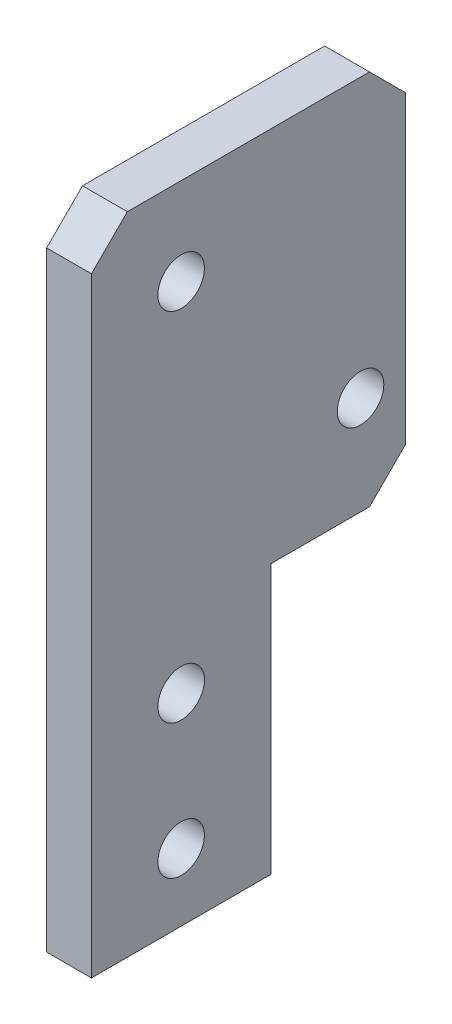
ISO-10303-21;
HEADER;
FILE_DESCRIPTION(('STEP AP214'),'2;1');
FILE_NAME('part.step','',(''),(''),'','','');
FILE_SCHEMA(('AUTOMOTIVE_DESIGN { 1 0 10303 214 1 1 1 1 }'));
ENDSEC;
DATA;
#1=APPLICATION_CONTEXT('core data for automotive mechanical design processes');
#2=APPLICATION_PROTOCOL_DEFINITION('international standard','automotive_design',2000,#1);
#3=PRODUCT_CONTEXT('',#1,'mechanical');
#4=PRODUCT('Part','Part','',(#3));
#5=PRODUCT_RELATED_PRODUCT_CATEGORY('part','',(#4));
#6=PRODUCT_DEFINITION_FORMATION('','',#4);
#7=PRODUCT_DEFINITION_CONTEXT('part definition',#1,'design');
#8=PRODUCT_DEFINITION('design','',#6,#7);
#9=PRODUCT_DEFINITION_SHAPE('','',#8);
#10=(LENGTH_UNIT() NAMED_UNIT(*) SI_UNIT(.MILLI.,.METRE.));
#11=(NAMED_UNIT(*) PLANE_ANGLE_UNIT() SI_UNIT($,.RADIAN.));
#12=(NAMED_UNIT(*) SI_UNIT($,.STERADIAN.) SOLID_ANGLE_UNIT());
#13=UNCERTAINTY_MEASURE_WITH_UNIT(LENGTH_MEASURE(1.E-05),#10,'distance_accuracy_value','');
#14=(GEOMETRIC_REPRESENTATION_CONTEXT(3) GLOBAL_UNCERTAINTY_ASSIGNED_CONTEXT((#13)) GLOBAL_UNIT_ASSIGNED_CONTEXT((#10,
#11,#12)) REPRESENTATION_CONTEXT('',''));
#15=CARTESIAN_POINT('',(0.,0.,0.));
#16=DIRECTION('',(0.,0.,1.));
#17=DIRECTION('',(1.,0.,0.));
#18=AXIS2_PLACEMENT_3D('',#15,#16,#17);
#19=CARTESIAN_POINT('',(2.49999994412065,19.0000003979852,7.99999999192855));
#20=DIRECTION('',(0.,-0.707106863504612,-0.707106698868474));
#21=DIRECTION('',(0.,0.707106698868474,-0.707106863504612));
#22=AXIS2_PLACEMENT_3D('',#19,#20,#21);
#23=PLANE('',#22);
#24=DIRECTION('',(0.,0.707106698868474,-0.707106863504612));
#25=VECTOR('',#24,1.);
#26=CARTESIAN_POINT('',(4.99999988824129,9.75000446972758,17.2499980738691));
#27=LINE('',#26,#25);
#28=CARTESIAN_POINT('',(4.99999988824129,20.9999997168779,6.00000020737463));
#29=VERTEX_POINT('',#28);
#30=CARTESIAN_POINT('',(4.99999988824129,17.0000010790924,9.99999977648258));
#31=VERTEX_POINT('',#30);
#32=EDGE_CURVE('E178',#29,#31,#27,.F.);
#33=ORIENTED_EDGE('',*,*,#32,.F.);
#34=DIRECTION('',(1.,0.,0.));
#35=VECTOR('',#34,1.);
#36=CARTESIAN_POINT('',(2.49999994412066,20.9999997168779,6.00000020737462));
#37=LINE('',#36,#35);
#38=CARTESIAN_POINT('',(1.53566395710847E-12,20.9999997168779,6.00000020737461));
#39=VERTEX_POINT('',#38);
#40=EDGE_CURVE('E233',#29,#39,#37,.F.);
#41=ORIENTED_EDGE('',*,*,#40,.T.);
#42=DIRECTION('',(0.,-0.707106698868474,0.707106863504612));
#43=VECTOR('',#42,1.);
#44=CARTESIAN_POINT('',(1.5859709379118E-12,19.0000003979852,7.99999999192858));
#45=LINE('',#44,#43);
#46=CARTESIAN_POINT('',(1.63671159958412E-12,17.0000010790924,9.99999977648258));
#47=VERTEX_POINT('',#46);
#48=EDGE_CURVE('E205',#39,#47,#45,.T.);
#49=ORIENTED_EDGE('',*,*,#48,.T.);
#50=DIRECTION('',(-1.,0.,0.));
#51=VECTOR('',#50,1.);
#52=CARTESIAN_POINT('',(2.49999994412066,17.0000010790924,9.99999977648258));
#53=LINE('',#52,#51);
#54=EDGE_CURVE('E201',#47,#31,#53,.F.);
#55=ORIENTED_EDGE('',*,*,#54,.T.);
#56=EDGE_LOOP('',(#33,#41,#49,#55));
#57=FACE_BOUND('',#56,.T.);
#58=ADVANCED_FACE('F62',(#57),#23,.F.);
#59=CARTESIAN_POINT('',(2.49999994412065,-20.9999997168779,-15.4999997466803));
#60=DIRECTION('',(0.,-1.,0.));
#61=DIRECTION('',(0.,0.,-1.));
#62=AXIS2_PLACEMENT_3D('',#59,#60,#61);
#63=PLANE('',#62);
#64=DIRECTION('',(-1.,0.,0.));
#65=VECTOR('',#64,1.);
#66=CARTESIAN_POINT('',(2.49999994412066,-20.9999997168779,-21.000000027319));
#67=LINE('',#66,#65);
#68=CARTESIAN_POINT('',(4.99999988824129,-20.9999997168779,-21.000000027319));
#69=VERTEX_POINT('',#68);
#70=CARTESIAN_POINT('',(-3.38271077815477E-13,-20.9999997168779,-21.000000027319));
#71=VERTEX_POINT('',#70);
#72=EDGE_CURVE('E82',#69,#71,#67,.T.);
#73=ORIENTED_EDGE('',*,*,#72,.F.);
#74=DIRECTION('',(0.,0.,1.));
#75=VECTOR('',#74,1.);
#76=CARTESIAN_POINT('',(4.99999988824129,-20.9999997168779,-15.4999997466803));
#77=LINE('',#76,#75);
#78=CARTESIAN_POINT('',(4.99999988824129,-20.9999997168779,-9.99999977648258));
#79=VERTEX_POINT('',#78);
#80=EDGE_CURVE('E146',#69,#79,#77,.T.);
#81=ORIENTED_EDGE('',*,*,#80,.T.);
#82=DIRECTION('',(-1.,0.,0.));
#83=VECTOR('',#82,1.);
#84=CARTESIAN_POINT('',(2.49999994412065,-20.9999997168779,-9.99999977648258));
#85=LINE('',#84,#83);
#86=CARTESIAN_POINT('',(1.29670579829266E-13,-20.9999997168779,-9.99999977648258));
#87=VERTEX_POINT('',#86);
#88=EDGE_CURVE('E149',#87,#79,#85,.F.);
#89=ORIENTED_EDGE('',*,*,#88,.F.);
#90=DIRECTION('',(0.,0.,1.));
#91=VECTOR('',#90,1.);
#92=CARTESIAN_POINT('',(-1.04517089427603E-13,-20.9999997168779,-15.4999997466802));
#93=LINE('',#92,#91);
#94=EDGE_CURVE('E164',#87,#71,#93,.F.);
#95=ORIENTED_EDGE('',*,*,#94,.T.);
#96=EDGE_LOOP('',(#73,#81,#89,#95));
#97=FACE_BOUND('',#96,.T.);
#98=ADVANCED_FACE('F148',(#97),#63,.T.);
#99=CARTESIAN_POINT('',(2.49999994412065,-50.9999990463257,0.));
#100=DIRECTION('',(0.,-1.,0.));
#101=DIRECTION('',(0.,0.,-1.));
#102=AXIS2_PLACEMENT_3D('',#99,#100,#101);
#103=PLANE('',#102);
#104=DIRECTION('',(0.,0.,-1.));
#105=VECTOR('',#104,1.);
#106=CARTESIAN_POINT('',(4.99999988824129,-50.9999990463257,-7.50000029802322));
#107=LINE('',#106,#105);
#108=CARTESIAN_POINT('',(4.99999988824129,-50.9999990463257,9.99999977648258));
#109=VERTEX_POINT('',#108);
#110=CARTESIAN_POINT('',(4.99999988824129,-50.9999990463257,-9.99999977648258));
#111=VERTEX_POINT('',#110);
#112=EDGE_CURVE('E168',#109,#111,#107,.T.);
#113=ORIENTED_EDGE('',*,*,#112,.F.);
#114=DIRECTION('',(1.,0.,0.));
#115=VECTOR('',#114,1.);
#116=CARTESIAN_POINT('',(2.49999994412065,-50.9999990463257,9.99999977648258));
#117=LINE('',#116,#115);
#118=CARTESIAN_POINT('',(4.61870125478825E-13,-50.9999990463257,9.99999977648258));
#119=VERTEX_POINT('',#118);
#120=EDGE_CURVE('E200',#119,#109,#117,.T.);
#121=ORIENTED_EDGE('',*,*,#120,.F.);
#122=DIRECTION('',(0.,0.,1.));
#123=VECTOR('',#122,1.);
#124=CARTESIAN_POINT('',(0.,-50.9999990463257,1.06344111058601E-13));
#125=LINE('',#124,#123);
#126=CARTESIAN_POINT('',(-3.88578058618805E-13,-50.9999990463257,-9.99999977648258));
#127=VERTEX_POINT('',#126);
#128=EDGE_CURVE('E180',#119,#127,#125,.F.);
#129=ORIENTED_EDGE('',*,*,#128,.T.);
#130=DIRECTION('',(-1.,0.,0.));
#131=VECTOR('',#130,1.);
#132=CARTESIAN_POINT('',(2.49999994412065,-50.9999990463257,-9.99999977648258));
#133=LINE('',#132,#131);
#134=EDGE_CURVE('E174',#127,#111,#133,.F.);
#135=ORIENTED_EDGE('',*,*,#134,.T.);
#136=EDGE_LOOP('',(#113,#121,#129,#135));
#137=FACE_BOUND('',#136,.T.);
#138=ADVANCED_FACE('F341',(#137),#103,.T.);
#139=CARTESIAN_POINT('',(2.49999994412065,19.0000004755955,-23.0000001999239));
#140=DIRECTION('',(0.,0.707106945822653,-0.707106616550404));
#141=DIRECTION('',(0.,0.707106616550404,0.707106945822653));
#142=AXIS2_PLACEMENT_3D('',#139,#140,#141);
#143=PLANE('',#142);
#144=DIRECTION('',(0.,0.707106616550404,0.707106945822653));
#145=VECTOR('',#144,1.);
#146=CARTESIAN_POINT('',(4.99999988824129,9.7500082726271,-32.2499967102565));
#147=LINE('',#146,#145);
#148=CARTESIAN_POINT('',(4.99999988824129,17.0000012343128,-25.000000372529));
#149=VERTEX_POINT('',#148);
#150=CARTESIAN_POINT('',(4.99999988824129,20.9999997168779,-21.000000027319));
#151=VERTEX_POINT('',#150);
#152=EDGE_CURVE('E189',#149,#151,#147,.T.);
#153=ORIENTED_EDGE('',*,*,#152,.F.);
#154=DIRECTION('',(-1.,0.,0.));
#155=VECTOR('',#154,1.);
#156=CARTESIAN_POINT('',(2.49999994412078,17.0000012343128,-25.000000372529));
#157=LINE('',#156,#155);
#158=CARTESIAN_POINT('',(1.48318857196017E-13,17.0000012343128,-25.000000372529));
#159=VERTEX_POINT('',#158);
#160=EDGE_CURVE('E186',#159,#149,#157,.F.);
#161=ORIENTED_EDGE('',*,*,#160,.F.);
#162=DIRECTION('',(0.,-0.707106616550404,-0.707106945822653));
#163=VECTOR('',#162,1.);
#164=CARTESIAN_POINT('',(2.67581096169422E-13,19.0000004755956,-23.0000001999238));
#165=LINE('',#164,#163);
#166=CARTESIAN_POINT('',(3.87277016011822E-13,20.9999997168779,-21.000000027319));
#167=VERTEX_POINT('',#166);
#168=EDGE_CURVE('E66',#159,#167,#165,.F.);
#169=ORIENTED_EDGE('',*,*,#168,.T.);
#170=DIRECTION('',(-1.,0.,0.));
#171=VECTOR('',#170,1.);
#172=CARTESIAN_POINT('',(2.49999994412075,20.9999997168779,-21.000000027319));
#173=LINE('',#172,#171);
#174=EDGE_CURVE('E299',#151,#167,#173,.T.);
#175=ORIENTED_EDGE('',*,*,#174,.F.);
#176=EDGE_LOOP('',(#153,#161,#169,#175));
#177=FACE_BOUND('',#176,.T.);
#178=ADVANCED_FACE('F319',(#177),#143,.T.);
#179=CARTESIAN_POINT('',(-8.99664717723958E-09,-43.4999987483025,-9.84071866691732E-12));
#180=DIRECTION('',(1.,3.46025186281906E-09,1.9674498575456E-12));
#181=DIRECTION('',(-3.46025186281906E-09,1.,0.));
#182=AXIS2_PLACEMENT_3D('',#179,#180,#181);
#183=CYLINDRICAL_SURFACE('',#182,2.59583311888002);
#184=CARTESIAN_POINT('',(4.99999988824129,-43.4999987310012,0.));
#185=DIRECTION('',(1.,0.,0.));
#186=DIRECTION('',(0.,0.,-1.));
#187=AXIS2_PLACEMENT_3D('',#184,#185,#186);
#188=CIRCLE('',#187,2.59583311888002);
#189=CARTESIAN_POINT('',(4.99999988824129,-43.4999987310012,-2.59583311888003));
#190=VERTEX_POINT('',#189);
#191=EDGE_CURVE('E229',#190,#190,#188,.F.);
#192=ORIENTED_EDGE('',*,*,#191,.F.);
#193=EDGE_LOOP('',(#192));
#194=FACE_BOUND('',#193,.T.);
#195=CARTESIAN_POINT('',(1.66394091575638E-13,-43.4999987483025,-9.84071864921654E-12));
#196=DIRECTION('',(1.,0.,0.));
#197=DIRECTION('',(0.,0.,-1.));
#198=AXIS2_PLACEMENT_3D('',#195,#196,#197);
#199=CIRCLE('',#198,2.59583311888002);
#200=CARTESIAN_POINT('',(0.,-43.4999987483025,-2.59583311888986));
#201=VERTEX_POINT('',#200);
#202=EDGE_CURVE('E210',#201,#201,#199,.F.);
#203=ORIENTED_EDGE('',*,*,#202,.T.);
#204=EDGE_LOOP('',(#203));
#205=FACE_BOUND('',#204,.T.);
#206=ADVANCED_FACE('F352',(#194,#205),#183,.F.);
#207=CARTESIAN_POINT('',(4.99999988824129,11.2500004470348,0.));
#208=DIRECTION('',(-1.,8.77201866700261E-10,0.));
#209=DIRECTION('',(-8.77201866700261E-10,-1.,0.));
#210=AXIS2_PLACEMENT_3D('',#207,#208,#209);
#211=CYLINDRICAL_SURFACE('',#210,2.59583360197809);
#212=CARTESIAN_POINT('',(4.99999988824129,11.2500004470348,0.));
#213=DIRECTION('',(1.,0.,0.));
#214=DIRECTION('',(0.,0.,-1.));
#215=AXIS2_PLACEMENT_3D('',#212,#213,#214);
#216=CIRCLE('',#215,2.59583360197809);
#217=CARTESIAN_POINT('',(4.99999988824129,11.2500004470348,-2.59583360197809));
#218=VERTEX_POINT('',#217);
#219=EDGE_CURVE('E12',#218,#218,#216,.F.);
#220=ORIENTED_EDGE('',*,*,#219,.F.);
#221=EDGE_LOOP('',(#220));
#222=FACE_BOUND('',#221,.T.);
#223=CARTESIAN_POINT('',(1.11282510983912E-12,11.2500004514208,0.));
#224=DIRECTION('',(1.,0.,0.));
#225=DIRECTION('',(0.,0.,-1.));
#226=AXIS2_PLACEMENT_3D('',#223,#224,#225);
#227=CIRCLE('',#226,2.59583360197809);
#228=CARTESIAN_POINT('',(1.00240446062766E-12,11.2500004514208,-2.59583360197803));
#229=VERTEX_POINT('',#228);
#230=EDGE_CURVE('E214',#229,#229,#227,.F.);
#231=ORIENTED_EDGE('',*,*,#230,.T.);
#232=EDGE_LOOP('',(#231));
#233=FACE_BOUND('',#232,.T.);
#234=ADVANCED_FACE('F472',(#222,#233),#211,.F.);
#235=CARTESIAN_POINT('',(4.99999988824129,-9.99999977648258,-19.9999995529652));
#236=DIRECTION('',(-1.,-7.79782127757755E-10,-1.55598445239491E-09));
#237=DIRECTION('',(-1.55598445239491E-09,0.,1.));
#238=AXIS2_PLACEMENT_3D('',#235,#236,#237);
#239=CYLINDRICAL_SURFACE('',#238,2.59583343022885);
#240=CARTESIAN_POINT('',(4.99999988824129,-9.99999977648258,-19.9999995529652));
#241=DIRECTION('',(1.,0.,0.));
#242=DIRECTION('',(0.,0.,-1.));
#243=AXIS2_PLACEMENT_3D('',#240,#241,#242);
#244=CIRCLE('',#243,2.59583343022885);
#245=CARTESIAN_POINT('',(4.99999988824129,-9.99999977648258,-22.595832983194));
#246=VERTEX_POINT('',#245);
#247=EDGE_CURVE('E226',#246,#246,#244,.F.);
#248=ORIENTED_EDGE('',*,*,#247,.F.);
#249=EDGE_LOOP('',(#248));
#250=FACE_BOUND('',#249,.T.);
#251=CARTESIAN_POINT('',(-1.04950770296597E-13,-9.99999978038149,-19.9999995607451));
#252=DIRECTION('',(1.,0.,0.));
#253=DIRECTION('',(0.,0.,-1.));
#254=AXIS2_PLACEMENT_3D('',#251,#252,#253);
#255=CIRCLE('',#254,2.59583343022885);
#256=CARTESIAN_POINT('',(-2.15371412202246E-13,-9.99999978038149,-22.5958329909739));
#257=VERTEX_POINT('',#256);
#258=EDGE_CURVE('E218',#257,#257,#255,.F.);
#259=ORIENTED_EDGE('',*,*,#258,.T.);
#260=EDGE_LOOP('',(#259));
#261=FACE_BOUND('',#260,.T.);
#262=ADVANCED_FACE('F403',(#250,#261),#239,.F.);
#263=CARTESIAN_POINT('',(-5.81983072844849E-09,-28.5000000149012,8.44198880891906E-13));
#264=DIRECTION('',(1.,2.23839546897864E-09,-1.69793880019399E-13));
#265=DIRECTION('',(-2.23839546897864E-09,1.,0.));
#266=AXIS2_PLACEMENT_3D('',#263,#264,#265);
#267=CYLINDRICAL_SURFACE('',#266,2.59583342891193);
#268=CARTESIAN_POINT('',(4.99999988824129,-28.5000000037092,0.));
#269=DIRECTION('',(1.,0.,0.));
#270=DIRECTION('',(0.,0.,-1.));
#271=AXIS2_PLACEMENT_3D('',#268,#269,#270);
#272=CIRCLE('',#271,2.59583342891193);
#273=CARTESIAN_POINT('',(4.99999988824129,-28.5000000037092,-2.59583342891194));
#274=VERTEX_POINT('',#273);
#275=EDGE_CURVE('E73',#274,#274,#272,.F.);
#276=ORIENTED_EDGE('',*,*,#275,.F.);
#277=EDGE_LOOP('',(#276));
#278=FACE_BOUND('',#277,.T.);
#279=CARTESIAN_POINT('',(4.25543595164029E-13,-28.5000000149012,8.44198879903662E-13));
#280=DIRECTION('',(1.,0.,0.));
#281=DIRECTION('',(0.,0.,-1.));
#282=AXIS2_PLACEMENT_3D('',#279,#280,#281);
#283=CIRCLE('',#282,2.59583342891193);
#284=CARTESIAN_POINT('',(3.15122953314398E-13,-28.5000000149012,-2.59583342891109));
#285=VERTEX_POINT('',#284);
#286=EDGE_CURVE('E222',#285,#285,#283,.F.);
#287=ORIENTED_EDGE('',*,*,#286,.T.);
#288=EDGE_LOOP('',(#287));
#289=FACE_BOUND('',#288,.T.);
#290=ADVANCED_FACE('F344',(#278,#289),#267,.F.);
#291=CARTESIAN_POINT('',(2.49999994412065,20.9999997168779,-7.49999983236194));
#292=DIRECTION('',(0.,1.,0.));
#293=DIRECTION('',(0.,0.,1.));
#294=AXIS2_PLACEMENT_3D('',#291,#292,#293);
#295=PLANE('',#294);
#296=ORIENTED_EDGE('',*,*,#174,.T.);
#297=DIRECTION('',(0.,0.,-1.));
#298=VECTOR('',#297,1.);
#299=CARTESIAN_POINT('',(9.61470486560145E-13,20.9999997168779,-7.49999983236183));
#300=LINE('',#299,#298);
#301=EDGE_CURVE('E130',#167,#39,#300,.F.);
#302=ORIENTED_EDGE('',*,*,#301,.T.);
#303=ORIENTED_EDGE('',*,*,#40,.F.);
#304=DIRECTION('',(0.,0.,-1.));
#305=VECTOR('',#304,1.);
#306=CARTESIAN_POINT('',(4.99999988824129,20.9999997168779,-7.49999983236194));
#307=LINE('',#306,#305);
#308=EDGE_CURVE('E138',#29,#151,#307,.T.);
#309=ORIENTED_EDGE('',*,*,#308,.T.);
#310=EDGE_LOOP('',(#296,#302,#303,#309));
#311=FACE_BOUND('',#310,.T.);
#312=ADVANCED_FACE('F317',(#311),#295,.T.);
#313=CARTESIAN_POINT('',(4.99999988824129,-14.9999996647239,-7.50000029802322));
#314=DIRECTION('',(1.,0.,0.));
#315=DIRECTION('',(0.,0.,-1.));
#316=AXIS2_PLACEMENT_3D('',#313,#314,#315);
#317=PLANE('',#316);
#318=ORIENTED_EDGE('',*,*,#191,.T.);
#319=EDGE_LOOP('',(#318));
#320=FACE_BOUND('',#319,.T.);
#321=ORIENTED_EDGE('',*,*,#247,.T.);
#322=EDGE_LOOP('',(#321));
#323=FACE_BOUND('',#322,.T.);
#324=ORIENTED_EDGE('',*,*,#275,.T.);
#325=EDGE_LOOP('',(#324));
#326=FACE_BOUND('',#325,.T.);
#327=ORIENTED_EDGE('',*,*,#219,.T.);
#328=EDGE_LOOP('',(#327));
#329=FACE_BOUND('',#328,.T.);
#330=ORIENTED_EDGE('',*,*,#308,.F.);
#331=ORIENTED_EDGE('',*,*,#32,.T.);
#332=DIRECTION('',(0.,-1.,0.));
#333=VECTOR('',#332,1.);
#334=CARTESIAN_POINT('',(4.99999988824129,-14.9999996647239,9.99999977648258));
#335=LINE('',#334,#333);
#336=EDGE_CURVE('E197',#31,#109,#335,.T.);
#337=ORIENTED_EDGE('',*,*,#336,.T.);
#338=ORIENTED_EDGE('',*,*,#112,.T.);
#339=DIRECTION('',(0.,-1.,0.));
#340=VECTOR('',#339,1.);
#341=CARTESIAN_POINT('',(4.99999988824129,-14.9999996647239,-9.99999977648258));
#342=LINE('',#341,#340);
#343=EDGE_CURVE('E159',#111,#79,#342,.F.);
#344=ORIENTED_EDGE('',*,*,#343,.T.);
#345=ORIENTED_EDGE('',*,*,#80,.F.);
#346=DIRECTION('',(0.,0.707106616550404,-0.707106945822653));
#347=VECTOR('',#346,1.);
#348=CARTESIAN_POINT('',(4.99999988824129,-24.7500009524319,-17.2499970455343));
#349=LINE('',#348,#347);
#350=CARTESIAN_POINT('',(4.99999988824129,-17.0000012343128,-25.000000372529));
#351=VERTEX_POINT('',#350);
#352=EDGE_CURVE('E154',#69,#351,#349,.T.);
#353=ORIENTED_EDGE('',*,*,#352,.T.);
#354=DIRECTION('',(0.,-1.,0.));
#355=VECTOR('',#354,1.);
#356=CARTESIAN_POINT('',(4.99999988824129,-14.9999996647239,-25.000000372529));
#357=LINE('',#356,#355);
#358=EDGE_CURVE('E182',#351,#149,#357,.F.);
#359=ORIENTED_EDGE('',*,*,#358,.T.);
#360=ORIENTED_EDGE('',*,*,#152,.T.);
#361=EDGE_LOOP('',(#330,#331,#337,#338,#344,#345,#353,#359,#360));
#362=FACE_BOUND('',#361,.T.);
#363=ADVANCED_FACE('F166',(#320,#323,#326,#329,#362),#317,.T.);
#364=CARTESIAN_POINT('',(2.49999994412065,-35.9999993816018,-9.99999977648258));
#365=DIRECTION('',(0.,0.,1.));
#366=DIRECTION('',(1.,0.,0.));
#367=AXIS2_PLACEMENT_3D('',#364,#365,#366);
#368=PLANE('',#367);
#369=ORIENTED_EDGE('',*,*,#134,.F.);
#370=DIRECTION('',(0.,1.,0.));
#371=VECTOR('',#370,1.);
#372=CARTESIAN_POINT('',(-1.29670579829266E-13,-35.9999993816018,-9.99999977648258));
#373=LINE('',#372,#371);
#374=EDGE_CURVE('E161',#127,#87,#373,.T.);
#375=ORIENTED_EDGE('',*,*,#374,.T.);
#376=ORIENTED_EDGE('',*,*,#88,.T.);
#377=ORIENTED_EDGE('',*,*,#343,.F.);
#378=EDGE_LOOP('',(#369,#375,#376,#377));
#379=FACE_BOUND('',#378,.T.);
#380=ADVANCED_FACE('F158',(#379),#368,.F.);
#381=CARTESIAN_POINT('',(2.49999994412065,0.,-25.000000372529));
#382=DIRECTION('',(0.,0.,1.));
#383=DIRECTION('',(1.,0.,0.));
#384=AXIS2_PLACEMENT_3D('',#381,#382,#383);
#385=PLANE('',#384);
#386=DIRECTION('',(1.,0.,0.));
#387=VECTOR('',#386,1.);
#388=CARTESIAN_POINT('',(2.4999999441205,-17.0000012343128,-25.000000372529));
#389=LINE('',#388,#387);
#390=CARTESIAN_POINT('',(-4.39318720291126E-13,-17.0000012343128,-25.000000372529));
#391=VERTEX_POINT('',#390);
#392=EDGE_CURVE('E185',#351,#391,#389,.F.);
#393=ORIENTED_EDGE('',*,*,#392,.T.);
#394=DIRECTION('',(0.,1.,0.));
#395=VECTOR('',#394,1.);
#396=CARTESIAN_POINT('',(-1.45283091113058E-13,0.,-25.000000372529));
#397=LINE('',#396,#395);
#398=EDGE_CURVE('E122',#391,#159,#397,.T.);
#399=ORIENTED_EDGE('',*,*,#398,.T.);
#400=ORIENTED_EDGE('',*,*,#160,.T.);
#401=ORIENTED_EDGE('',*,*,#358,.F.);
#402=EDGE_LOOP('',(#393,#399,#400,#401));
#403=FACE_BOUND('',#402,.T.);
#404=ADVANCED_FACE('F323',(#403),#385,.F.);
#405=CARTESIAN_POINT('',(2.49999994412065,-19.0000004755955,-23.0000001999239));
#406=DIRECTION('',(0.,-0.707106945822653,-0.707106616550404));
#407=DIRECTION('',(0.,0.707106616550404,-0.707106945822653));
#408=AXIS2_PLACEMENT_3D('',#405,#406,#407);
#409=PLANE('',#408);
#410=ORIENTED_EDGE('',*,*,#352,.F.);
#411=ORIENTED_EDGE('',*,*,#72,.T.);
#412=DIRECTION('',(0.,-0.707106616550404,0.707106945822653));
#413=VECTOR('',#412,1.);
#414=CARTESIAN_POINT('',(-3.88578058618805E-13,-19.0000004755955,-23.0000001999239));
#415=LINE('',#414,#413);
#416=EDGE_CURVE('E194',#71,#391,#415,.F.);
#417=ORIENTED_EDGE('',*,*,#416,.T.);
#418=ORIENTED_EDGE('',*,*,#392,.F.);
#419=EDGE_LOOP('',(#410,#411,#417,#418));
#420=FACE_BOUND('',#419,.T.);
#421=ADVANCED_FACE('F325',(#420),#409,.T.);
#422=CARTESIAN_POINT('',(2.49999994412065,-16.9999990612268,9.99999977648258));
#423=DIRECTION('',(0.,0.,1.));
#424=DIRECTION('',(1.,0.,0.));
#425=AXIS2_PLACEMENT_3D('',#422,#423,#424);
#426=PLANE('',#425);
#427=ORIENTED_EDGE('',*,*,#54,.F.);
#428=DIRECTION('',(0.,1.,0.));
#429=VECTOR('',#428,1.);
#430=CARTESIAN_POINT('',(1.04907402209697E-12,-16.9999990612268,9.99999977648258));
#431=LINE('',#430,#429);
#432=EDGE_CURVE('E209',#47,#119,#431,.F.);
#433=ORIENTED_EDGE('',*,*,#432,.T.);
#434=ORIENTED_EDGE('',*,*,#120,.T.);
#435=ORIENTED_EDGE('',*,*,#336,.F.);
#436=EDGE_LOOP('',(#427,#433,#434,#435));
#437=FACE_BOUND('',#436,.T.);
#438=ADVANCED_FACE('F327',(#437),#426,.T.);
#439=CARTESIAN_POINT('',(3.39745821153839E-13,-14.9999996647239,-7.50000029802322));
#440=DIRECTION('',(1.,0.,0.));
#441=DIRECTION('',(0.,0.,-1.));
#442=AXIS2_PLACEMENT_3D('',#439,#440,#441);
#443=PLANE('',#442);
#444=ORIENTED_EDGE('',*,*,#202,.F.);
#445=EDGE_LOOP('',(#444));
#446=FACE_BOUND('',#445,.T.);
#447=ORIENTED_EDGE('',*,*,#230,.F.);
#448=EDGE_LOOP('',(#447));
#449=FACE_BOUND('',#448,.T.);
#450=ORIENTED_EDGE('',*,*,#258,.F.);
#451=EDGE_LOOP('',(#450));
#452=FACE_BOUND('',#451,.T.);
#453=ORIENTED_EDGE('',*,*,#286,.F.);
#454=EDGE_LOOP('',(#453));
#455=FACE_BOUND('',#454,.T.);
#456=ORIENTED_EDGE('',*,*,#301,.F.);
#457=ORIENTED_EDGE('',*,*,#168,.F.);
#458=ORIENTED_EDGE('',*,*,#398,.F.);
#459=ORIENTED_EDGE('',*,*,#416,.F.);
#460=ORIENTED_EDGE('',*,*,#94,.F.);
#461=ORIENTED_EDGE('',*,*,#374,.F.);
#462=ORIENTED_EDGE('',*,*,#128,.F.);
#463=ORIENTED_EDGE('',*,*,#432,.F.);
#464=ORIENTED_EDGE('',*,*,#48,.F.);
#465=EDGE_LOOP('',(#456,#457,#458,#459,#460,#461,#462,#463,#464));
#466=FACE_BOUND('',#465,.T.);
#467=ADVANCED_FACE('F64',(#446,#449,#452,#455,#466),#443,.F.);
#468=CLOSED_SHELL('',(#58,#98,#138,#178,#206,#234,#262,#290,#312,#363,#380,#404,#421,#438,#467));
#469=MANIFOLD_SOLID_BREP('B2',#468);
#470=ADVANCED_BREP_SHAPE_REPRESENTATION('',(#18,#469),#14);
#471=SHAPE_DEFINITION_REPRESENTATION(#9,#470);
ENDSEC;
END-ISO-10303-21;
